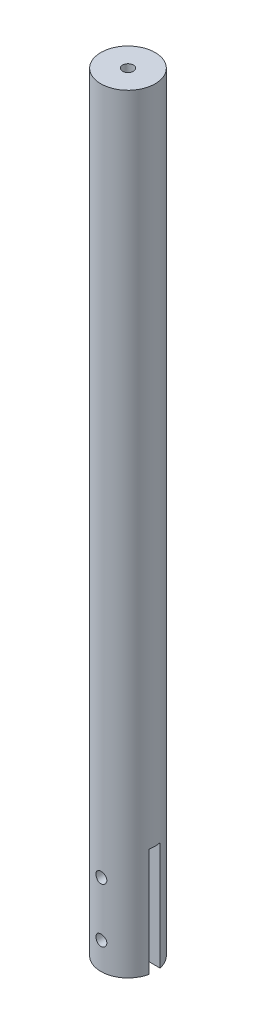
from build123d import *

# Parameters (mm, degrees)
CROQUIS2_R                 = 15
SALIENTE_EXTRUIR1_DEPTH    = 425
CROQUIS3_R                 = 3
CORTAR_EXTRUIR1_DEPTH      = 30
CROQUIS4_W                 = 52.209940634
CROQUIS4_H                 = 6
CORTAR_EXTRUIR2_DEPTH      = 60
CORTAR_EXTRUIR3_DEPTH      = 426.529082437
CORTAR_EXTRUIR3_DEPTH_BACK = 426.529082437
CROQUIS5_R                 = 3


with BuildPart() as part:
    # Croquis2 → Saliente-Extruir1 (new body)
    with BuildSketch(Plane(origin=(0, 0, 0), x_dir=(1, 0, 0), z_dir=(0, 1, 0))):
        with Locations(Location((0, 0, 0), (0, 0, 270))):
            Circle(CROQUIS2_R)
    extrude(amount=SALIENTE_EXTRUIR1_DEPTH)

    # Croquis3 → Cortar-Extruir1 (cut)
    with BuildSketch(Plane(origin=(0, 425, 0), x_dir=(1, 0, 0), z_dir=(0, 1, 0))):
        with Locations(Location((0, 0, 0), (0, 0, 270))):
            Circle(CROQUIS3_R)
    extrude(amount=-CORTAR_EXTRUIR1_DEPTH, mode=Mode.SUBTRACT)

    # Croquis4 → Cortar-Extruir2 (cut)
    with BuildSketch(Plane.XZ):
        Rectangle(CROQUIS4_W, CROQUIS4_H)
    extrude(amount=-CORTAR_EXTRUIR2_DEPTH, mode=Mode.SUBTRACT)

    # Croquis5 → Cortar-Extruir3 (cut, two sides: drawn at the far end of the back side and taken through both)
    with BuildSketch(Plane.XY.offset(-CORTAR_EXTRUIR3_DEPTH_BACK)):
        with Locations((0, 45)):
            Circle(CROQUIS5_R)
        with Locations((0, 15)):
            Circle(CROQUIS5_R)
    extrude(amount=CORTAR_EXTRUIR3_DEPTH + CORTAR_EXTRUIR3_DEPTH_BACK, mode=Mode.SUBTRACT)


solid = part.part
